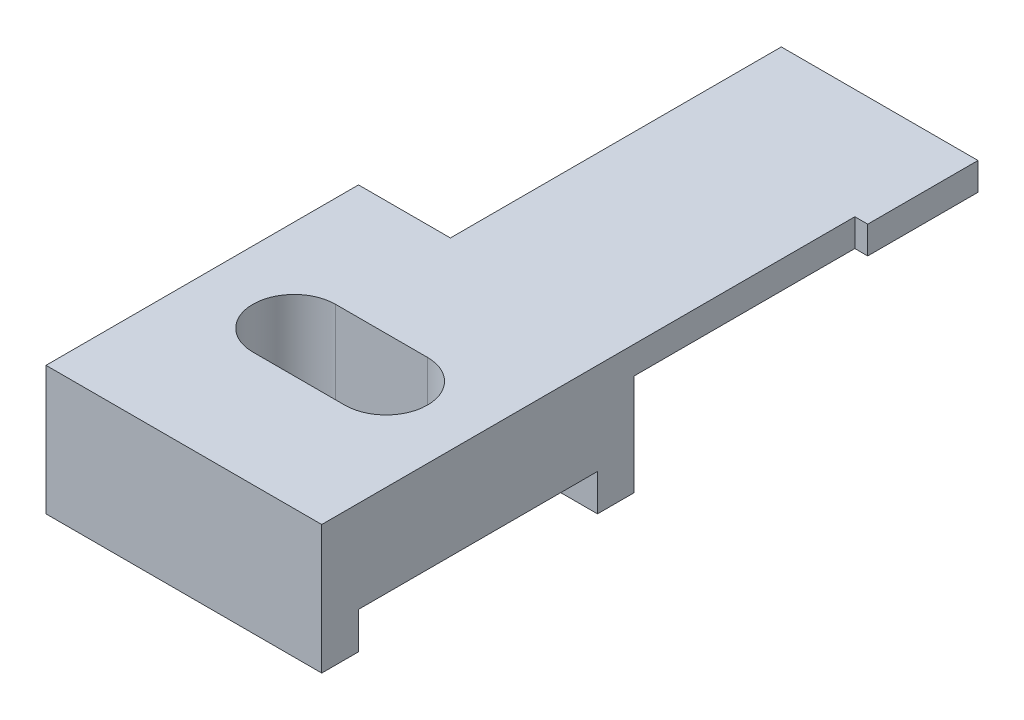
ISO-10303-21;
HEADER;
FILE_DESCRIPTION(('STEP AP214'),'2;1');
FILE_NAME('part.step','',(''),(''),'','','');
FILE_SCHEMA(('AUTOMOTIVE_DESIGN { 1 0 10303 214 1 1 1 1 }'));
ENDSEC;
DATA;
#1=APPLICATION_CONTEXT('core data for automotive mechanical design processes');
#2=APPLICATION_PROTOCOL_DEFINITION('international standard','automotive_design',2000,#1);
#3=PRODUCT_CONTEXT('',#1,'mechanical');
#4=PRODUCT('Part','Part','',(#3));
#5=PRODUCT_RELATED_PRODUCT_CATEGORY('part','',(#4));
#6=PRODUCT_DEFINITION_FORMATION('','',#4);
#7=PRODUCT_DEFINITION_CONTEXT('part definition',#1,'design');
#8=PRODUCT_DEFINITION('design','',#6,#7);
#9=PRODUCT_DEFINITION_SHAPE('','',#8);
#10=(LENGTH_UNIT() NAMED_UNIT(*) SI_UNIT(.MILLI.,.METRE.));
#11=(NAMED_UNIT(*) PLANE_ANGLE_UNIT() SI_UNIT($,.RADIAN.));
#12=(NAMED_UNIT(*) SI_UNIT($,.STERADIAN.) SOLID_ANGLE_UNIT());
#13=UNCERTAINTY_MEASURE_WITH_UNIT(LENGTH_MEASURE(1.E-05),#10,'distance_accuracy_value','');
#14=(GEOMETRIC_REPRESENTATION_CONTEXT(3) GLOBAL_UNCERTAINTY_ASSIGNED_CONTEXT((#13)) GLOBAL_UNIT_ASSIGNED_CONTEXT((#10,
#11,#12)) REPRESENTATION_CONTEXT('',''));
#15=CARTESIAN_POINT('',(0.,0.,0.));
#16=DIRECTION('',(0.,0.,1.));
#17=DIRECTION('',(1.,0.,0.));
#18=AXIS2_PLACEMENT_3D('',#15,#16,#17);
#19=CARTESIAN_POINT('',(0.,0.,35.));
#20=DIRECTION('',(1.,0.,0.));
#21=DIRECTION('',(0.,0.,-1.));
#22=AXIS2_PLACEMENT_3D('',#19,#20,#21);
#23=PLANE('',#22);
#24=DIRECTION('',(0.,0.,-1.));
#25=VECTOR('',#24,1.);
#26=CARTESIAN_POINT('',(0.,7.,35.));
#27=LINE('',#26,#25);
#28=CARTESIAN_POINT('',(0.,7.,35.));
#29=VERTEX_POINT('',#28);
#30=CARTESIAN_POINT('',(0.,7.,18.0000000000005));
#31=VERTEX_POINT('',#30);
#32=EDGE_CURVE('E256',#29,#31,#27,.T.);
#33=ORIENTED_EDGE('',*,*,#32,.T.);
#34=DIRECTION('',(0.,1.,-1.65902645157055E-13));
#35=VECTOR('',#34,1.);
#36=CARTESIAN_POINT('',(0.,-2.82034496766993E-12,18.));
#37=LINE('',#36,#35);
#38=CARTESIAN_POINT('',(0.,-1.13686837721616E-13,18.));
#39=VERTEX_POINT('',#38);
#40=EDGE_CURVE('E232',#39,#31,#37,.T.);
#41=ORIENTED_EDGE('',*,*,#40,.F.);
#42=DIRECTION('',(0.,0.,-1.));
#43=VECTOR('',#42,1.);
#44=CARTESIAN_POINT('',(0.,0.,35.));
#45=LINE('',#44,#43);
#46=CARTESIAN_POINT('',(0.,-1.13686837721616E-13,20.));
#47=VERTEX_POINT('',#46);
#48=EDGE_CURVE('E252',#47,#39,#45,.T.);
#49=ORIENTED_EDGE('',*,*,#48,.F.);
#50=DIRECTION('',(0.,-1.,0.));
#51=VECTOR('',#50,1.);
#52=CARTESIAN_POINT('',(0.,0.,20.));
#53=LINE('',#52,#51);
#54=CARTESIAN_POINT('',(0.,1.99999999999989,20.));
#55=VERTEX_POINT('',#54);
#56=EDGE_CURVE('E230',#55,#47,#53,.T.);
#57=ORIENTED_EDGE('',*,*,#56,.F.);
#58=DIRECTION('',(0.,0.,-1.));
#59=VECTOR('',#58,1.);
#60=CARTESIAN_POINT('',(0.,1.99999999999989,35.));
#61=LINE('',#60,#59);
#62=CARTESIAN_POINT('',(0.,1.99999999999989,33.0000000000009));
#63=VERTEX_POINT('',#62);
#64=EDGE_CURVE('E228',#63,#55,#61,.T.);
#65=ORIENTED_EDGE('',*,*,#64,.F.);
#66=DIRECTION('',(0.,1.,4.54497550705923E-13));
#67=VECTOR('',#66,1.);
#68=CARTESIAN_POINT('',(0.,9.08995101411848E-13,33.));
#69=LINE('',#68,#67);
#70=CARTESIAN_POINT('',(0.,-1.13686837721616E-13,33.));
#71=VERTEX_POINT('',#70);
#72=EDGE_CURVE('E214',#71,#63,#69,.T.);
#73=ORIENTED_EDGE('',*,*,#72,.F.);
#74=CARTESIAN_POINT('',(0.,0.,35.));
#75=VERTEX_POINT('',#74);
#76=EDGE_CURVE('E253',#75,#71,#45,.T.);
#77=ORIENTED_EDGE('',*,*,#76,.F.);
#78=DIRECTION('',(0.,-1.,0.));
#79=VECTOR('',#78,1.);
#80=CARTESIAN_POINT('',(0.,0.,35.));
#81=LINE('',#80,#79);
#82=EDGE_CURVE('E236',#29,#75,#81,.T.);
#83=ORIENTED_EDGE('',*,*,#82,.F.);
#84=EDGE_LOOP('',(#33,#41,#49,#57,#65,#73,#77,#83));
#85=FACE_BOUND('',#84,.T.);
#86=ADVANCED_FACE('F34',(#85),#23,.F.);
#87=CARTESIAN_POINT('',(15.7000000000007,5.5,0.));
#88=DIRECTION('',(0.,0.,1.));
#89=DIRECTION('',(1.,0.,0.));
#90=AXIS2_PLACEMENT_3D('',#87,#88,#89);
#91=PLANE('',#90);
#92=DIRECTION('',(0.,1.,0.));
#93=VECTOR('',#92,1.);
#94=CARTESIAN_POINT('',(5.,-28.,4.54747350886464E-13));
#95=LINE('',#94,#93);
#96=CARTESIAN_POINT('',(5.,5.5,4.54747350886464E-13));
#97=VERTEX_POINT('',#96);
#98=CARTESIAN_POINT('',(5.,7.,4.54747350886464E-13));
#99=VERTEX_POINT('',#98);
#100=EDGE_CURVE('E182',#97,#99,#95,.T.);
#101=ORIENTED_EDGE('',*,*,#100,.T.);
#102=DIRECTION('',(-1.,0.,0.));
#103=VECTOR('',#102,1.);
#104=CARTESIAN_POINT('',(0.,7.,0.));
#105=LINE('',#104,#103);
#106=CARTESIAN_POINT('',(15.7000000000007,7.,0.));
#107=VERTEX_POINT('',#106);
#108=EDGE_CURVE('E237',#107,#99,#105,.T.);
#109=ORIENTED_EDGE('',*,*,#108,.F.);
#110=DIRECTION('',(0.,1.,0.));
#111=VECTOR('',#110,1.);
#112=CARTESIAN_POINT('',(15.7000000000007,5.5,0.));
#113=LINE('',#112,#111);
#114=CARTESIAN_POINT('',(15.7000000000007,5.5,0.));
#115=VERTEX_POINT('',#114);
#116=EDGE_CURVE('E244',#115,#107,#113,.T.);
#117=ORIENTED_EDGE('',*,*,#116,.F.);
#118=DIRECTION('',(1.,0.,0.));
#119=VECTOR('',#118,1.);
#120=CARTESIAN_POINT('',(15.0000000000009,5.5,0.));
#121=LINE('',#120,#119);
#122=EDGE_CURVE('E234',#97,#115,#121,.T.);
#123=ORIENTED_EDGE('',*,*,#122,.F.);
#124=EDGE_LOOP('',(#101,#109,#117,#123));
#125=FACE_BOUND('',#124,.T.);
#126=ADVANCED_FACE('F314',(#125),#91,.F.);
#127=CARTESIAN_POINT('',(15.0000000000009,5.5,35.));
#128=DIRECTION('',(0.,1.,0.));
#129=DIRECTION('',(0.,0.,1.));
#130=AXIS2_PLACEMENT_3D('',#127,#128,#129);
#131=PLANE('',#130);
#132=DIRECTION('',(0.,0.,1.));
#133=VECTOR('',#132,1.);
#134=CARTESIAN_POINT('',(5.,5.5,35.));
#135=LINE('',#134,#133);
#136=CARTESIAN_POINT('',(5.,5.49999999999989,18.0000000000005));
#137=VERTEX_POINT('',#136);
#138=EDGE_CURVE('E187',#97,#137,#135,.T.);
#139=ORIENTED_EDGE('',*,*,#138,.F.);
#140=ORIENTED_EDGE('',*,*,#122,.T.);
#141=DIRECTION('',(0.,0.,-1.));
#142=VECTOR('',#141,1.);
#143=CARTESIAN_POINT('',(15.7000000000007,5.5,35.));
#144=LINE('',#143,#142);
#145=CARTESIAN_POINT('',(15.6999999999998,5.5,6.00000000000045));
#146=VERTEX_POINT('',#145);
#147=EDGE_CURVE('E261',#146,#115,#144,.T.);
#148=ORIENTED_EDGE('',*,*,#147,.F.);
#149=DIRECTION('',(1.,0.,0.));
#150=VECTOR('',#149,1.);
#151=CARTESIAN_POINT('',(15.0000000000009,5.5,6.00000000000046));
#152=LINE('',#151,#150);
#153=CARTESIAN_POINT('',(15.0000000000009,5.5,6.00000000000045));
#154=VERTEX_POINT('',#153);
#155=EDGE_CURVE('E189',#154,#146,#152,.T.);
#156=ORIENTED_EDGE('',*,*,#155,.F.);
#157=DIRECTION('',(0.,0.,-1.));
#158=VECTOR('',#157,1.);
#159=CARTESIAN_POINT('',(15.,5.5,35.));
#160=LINE('',#159,#158);
#161=CARTESIAN_POINT('',(15.0000000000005,5.49999999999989,17.9999999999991));
#162=VERTEX_POINT('',#161);
#163=EDGE_CURVE('E159',#162,#154,#160,.T.);
#164=ORIENTED_EDGE('',*,*,#163,.F.);
#165=DIRECTION('',(1.,0.,0.));
#166=VECTOR('',#165,1.);
#167=CARTESIAN_POINT('',(-19.2999999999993,5.49999999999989,17.9999999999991));
#168=LINE('',#167,#166);
#169=EDGE_CURVE('E205',#137,#162,#168,.T.);
#170=ORIENTED_EDGE('',*,*,#169,.F.);
#171=EDGE_LOOP('',(#139,#140,#148,#156,#164,#170));
#172=FACE_BOUND('',#171,.T.);
#173=ADVANCED_FACE('F36',(#172),#131,.F.);
#174=CARTESIAN_POINT('',(15.7000000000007,5.5,35.));
#175=DIRECTION('',(-1.,0.,0.));
#176=DIRECTION('',(0.,0.,1.));
#177=AXIS2_PLACEMENT_3D('',#174,#175,#176);
#178=PLANE('',#177);
#179=DIRECTION('',(0.,1.,0.));
#180=VECTOR('',#179,1.);
#181=CARTESIAN_POINT('',(15.6999999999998,-28.,6.00000000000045));
#182=LINE('',#181,#180);
#183=CARTESIAN_POINT('',(15.6999999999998,7.,6.00000000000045));
#184=VERTEX_POINT('',#183);
#185=EDGE_CURVE('E162',#146,#184,#182,.T.);
#186=ORIENTED_EDGE('',*,*,#185,.F.);
#187=ORIENTED_EDGE('',*,*,#147,.T.);
#188=ORIENTED_EDGE('',*,*,#116,.T.);
#189=DIRECTION('',(0.,0.,-1.));
#190=VECTOR('',#189,1.);
#191=CARTESIAN_POINT('',(15.7000000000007,7.,35.));
#192=LINE('',#191,#190);
#193=EDGE_CURVE('E259',#184,#107,#192,.T.);
#194=ORIENTED_EDGE('',*,*,#193,.F.);
#195=EDGE_LOOP('',(#186,#187,#188,#194));
#196=FACE_BOUND('',#195,.T.);
#197=ADVANCED_FACE('F303',(#196),#178,.F.);
#198=CARTESIAN_POINT('',(0.,7.,35.));
#199=DIRECTION('',(0.,-1.,0.));
#200=DIRECTION('',(0.,0.,-1.));
#201=AXIS2_PLACEMENT_3D('',#198,#199,#200);
#202=PLANE('',#201);
#203=DIRECTION('',(-1.,0.,0.));
#204=VECTOR('',#203,1.);
#205=CARTESIAN_POINT('',(10.,7.,24.2500000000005));
#206=LINE('',#205,#204);
#207=CARTESIAN_POINT('',(10.,7.,24.2500000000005));
#208=VERTEX_POINT('',#207);
#209=CARTESIAN_POINT('',(5.,7.,24.2500000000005));
#210=VERTEX_POINT('',#209);
#211=EDGE_CURVE('E193',#208,#210,#206,.T.);
#212=ORIENTED_EDGE('',*,*,#211,.F.);
#213=CARTESIAN_POINT('',(10.,7.,26.5000000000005));
#214=DIRECTION('',(0.,1.,0.));
#215=DIRECTION('',(0.,0.,1.));
#216=AXIS2_PLACEMENT_3D('',#213,#214,#215);
#217=CIRCLE('',#216,2.25);
#218=CARTESIAN_POINT('',(10.,7.,28.7500000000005));
#219=VERTEX_POINT('',#218);
#220=EDGE_CURVE('E191',#219,#208,#217,.T.);
#221=ORIENTED_EDGE('',*,*,#220,.F.);
#222=DIRECTION('',(1.,0.,0.));
#223=VECTOR('',#222,1.);
#224=CARTESIAN_POINT('',(5.,7.,28.7500000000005));
#225=LINE('',#224,#223);
#226=CARTESIAN_POINT('',(5.,7.,28.7500000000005));
#227=VERTEX_POINT('',#226);
#228=EDGE_CURVE('E199',#227,#219,#225,.T.);
#229=ORIENTED_EDGE('',*,*,#228,.F.);
#230=CARTESIAN_POINT('',(5.,7.,26.5000000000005));
#231=DIRECTION('',(0.,1.,0.));
#232=DIRECTION('',(0.,0.,1.));
#233=AXIS2_PLACEMENT_3D('',#230,#231,#232);
#234=CIRCLE('',#233,2.25);
#235=EDGE_CURVE('E196',#210,#227,#234,.T.);
#236=ORIENTED_EDGE('',*,*,#235,.F.);
#237=EDGE_LOOP('',(#212,#221,#229,#236));
#238=FACE_BOUND('',#237,.T.);
#239=DIRECTION('',(-1.,0.,0.));
#240=VECTOR('',#239,1.);
#241=CARTESIAN_POINT('',(0.,7.,18.0000000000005));
#242=LINE('',#241,#240);
#243=CARTESIAN_POINT('',(5.,7.,18.0000000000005));
#244=VERTEX_POINT('',#243);
#245=EDGE_CURVE('E49',#244,#31,#242,.T.);
#246=ORIENTED_EDGE('',*,*,#245,.T.);
#247=ORIENTED_EDGE('',*,*,#32,.F.);
#248=DIRECTION('',(-1.,0.,0.));
#249=VECTOR('',#248,1.);
#250=CARTESIAN_POINT('',(0.,7.,35.));
#251=LINE('',#250,#249);
#252=CARTESIAN_POINT('',(15.,7.,35.));
#253=VERTEX_POINT('',#252);
#254=EDGE_CURVE('E174',#253,#29,#251,.T.);
#255=ORIENTED_EDGE('',*,*,#254,.F.);
#256=DIRECTION('',(0.,0.,-1.));
#257=VECTOR('',#256,1.);
#258=CARTESIAN_POINT('',(15.,7.,35.0000000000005));
#259=LINE('',#258,#257);
#260=CARTESIAN_POINT('',(15.0000000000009,7.,6.00000000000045));
#261=VERTEX_POINT('',#260);
#262=EDGE_CURVE('E157',#253,#261,#259,.T.);
#263=ORIENTED_EDGE('',*,*,#262,.T.);
#264=DIRECTION('',(1.,0.,0.));
#265=VECTOR('',#264,1.);
#266=CARTESIAN_POINT('',(15.0000000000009,7.,6.00000000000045));
#267=LINE('',#266,#265);
#268=EDGE_CURVE('E165',#261,#184,#267,.T.);
#269=ORIENTED_EDGE('',*,*,#268,.T.);
#270=ORIENTED_EDGE('',*,*,#193,.T.);
#271=ORIENTED_EDGE('',*,*,#108,.T.);
#272=DIRECTION('',(0.,0.,1.));
#273=VECTOR('',#272,1.);
#274=CARTESIAN_POINT('',(5.,7.,18.0000000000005));
#275=LINE('',#274,#273);
#276=EDGE_CURVE('E170',#99,#244,#275,.T.);
#277=ORIENTED_EDGE('',*,*,#276,.T.);
#278=EDGE_LOOP('',(#246,#247,#255,#263,#269,#270,#271,#277));
#279=FACE_BOUND('',#278,.T.);
#280=ADVANCED_FACE('F172',(#238,#279),#202,.F.);
#281=CARTESIAN_POINT('',(15.7000000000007,5.5,35.));
#282=DIRECTION('',(0.,0.,1.));
#283=DIRECTION('',(1.,0.,0.));
#284=AXIS2_PLACEMENT_3D('',#281,#282,#283);
#285=PLANE('',#284);
#286=DIRECTION('',(0.,1.,0.));
#287=VECTOR('',#286,1.);
#288=CARTESIAN_POINT('',(15.0000000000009,0.,35.));
#289=LINE('',#288,#287);
#290=CARTESIAN_POINT('',(15.0000000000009,0.,35.));
#291=VERTEX_POINT('',#290);
#292=EDGE_CURVE('E57',#291,#253,#289,.T.);
#293=ORIENTED_EDGE('',*,*,#292,.T.);
#294=ORIENTED_EDGE('',*,*,#254,.T.);
#295=ORIENTED_EDGE('',*,*,#82,.T.);
#296=DIRECTION('',(1.,0.,0.));
#297=VECTOR('',#296,1.);
#298=CARTESIAN_POINT('',(0.,0.,35.));
#299=LINE('',#298,#297);
#300=EDGE_CURVE('E239',#75,#291,#299,.T.);
#301=ORIENTED_EDGE('',*,*,#300,.T.);
#302=EDGE_LOOP('',(#293,#294,#295,#301));
#303=FACE_BOUND('',#302,.T.);
#304=ADVANCED_FACE('F302',(#303),#285,.T.);
#305=CARTESIAN_POINT('',(0.,0.,35.));
#306=DIRECTION('',(0.,1.,0.));
#307=DIRECTION('',(0.,0.,1.));
#308=AXIS2_PLACEMENT_3D('',#305,#306,#307);
#309=PLANE('',#308);
#310=DIRECTION('',(1.,0.,0.));
#311=VECTOR('',#310,1.);
#312=CARTESIAN_POINT('',(-19.2999999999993,-1.13686837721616E-13,18.));
#313=LINE('',#312,#311);
#314=CARTESIAN_POINT('',(15.0000000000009,-1.13686837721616E-13,18.));
#315=VERTEX_POINT('',#314);
#316=EDGE_CURVE('E212',#39,#315,#313,.T.);
#317=ORIENTED_EDGE('',*,*,#316,.T.);
#318=DIRECTION('',(0.,0.,-1.));
#319=VECTOR('',#318,1.);
#320=CARTESIAN_POINT('',(15.0000000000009,0.,35.));
#321=LINE('',#320,#319);
#322=CARTESIAN_POINT('',(15.0000000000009,-1.13686837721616E-13,20.));
#323=VERTEX_POINT('',#322);
#324=EDGE_CURVE('E242',#323,#315,#321,.T.);
#325=ORIENTED_EDGE('',*,*,#324,.F.);
#326=DIRECTION('',(1.,0.,0.));
#327=VECTOR('',#326,1.);
#328=CARTESIAN_POINT('',(-19.2999999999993,-1.13686837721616E-13,20.));
#329=LINE('',#328,#327);
#330=EDGE_CURVE('E215',#47,#323,#329,.T.);
#331=ORIENTED_EDGE('',*,*,#330,.F.);
#332=ORIENTED_EDGE('',*,*,#48,.T.);
#333=EDGE_LOOP('',(#317,#325,#331,#332));
#334=FACE_BOUND('',#333,.T.);
#335=ADVANCED_FACE('F309',(#334),#309,.F.);
#336=DIRECTION('',(1.,0.,0.));
#337=VECTOR('',#336,1.);
#338=CARTESIAN_POINT('',(-19.2999999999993,-1.13686837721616E-13,33.));
#339=LINE('',#338,#337);
#340=CARTESIAN_POINT('',(15.0000000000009,-1.13686837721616E-13,33.));
#341=VERTEX_POINT('',#340);
#342=EDGE_CURVE('E222',#71,#341,#339,.T.);
#343=ORIENTED_EDGE('',*,*,#342,.T.);
#344=EDGE_CURVE('E249',#291,#341,#321,.T.);
#345=ORIENTED_EDGE('',*,*,#344,.F.);
#346=ORIENTED_EDGE('',*,*,#300,.F.);
#347=ORIENTED_EDGE('',*,*,#76,.T.);
#348=EDGE_LOOP('',(#343,#345,#346,#347));
#349=FACE_BOUND('',#348,.T.);
#350=ADVANCED_FACE('F324',(#349),#309,.F.);
#351=CARTESIAN_POINT('',(15.0000000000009,0.,35.));
#352=DIRECTION('',(-1.,0.,0.));
#353=DIRECTION('',(0.,0.,1.));
#354=AXIS2_PLACEMENT_3D('',#351,#352,#353);
#355=PLANE('',#354);
#356=DIRECTION('',(0.,-1.,1.65902645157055E-13));
#357=VECTOR('',#356,1.);
#358=CARTESIAN_POINT('',(15.0000000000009,-2.82034496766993E-12,18.));
#359=LINE('',#358,#357);
#360=EDGE_CURVE('E271',#162,#315,#359,.T.);
#361=ORIENTED_EDGE('',*,*,#360,.F.);
#362=ORIENTED_EDGE('',*,*,#163,.T.);
#363=DIRECTION('',(0.,1.,0.));
#364=VECTOR('',#363,1.);
#365=CARTESIAN_POINT('',(15.0000000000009,-28.,6.00000000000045));
#366=LINE('',#365,#364);
#367=EDGE_CURVE('E152',#154,#261,#366,.T.);
#368=ORIENTED_EDGE('',*,*,#367,.T.);
#369=ORIENTED_EDGE('',*,*,#262,.F.);
#370=ORIENTED_EDGE('',*,*,#292,.F.);
#371=ORIENTED_EDGE('',*,*,#344,.T.);
#372=DIRECTION('',(0.,-1.,-4.54497550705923E-13));
#373=VECTOR('',#372,1.);
#374=CARTESIAN_POINT('',(15.0000000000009,9.08995101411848E-13,33.));
#375=LINE('',#374,#373);
#376=CARTESIAN_POINT('',(15.0000000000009,1.99999999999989,33.0000000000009));
#377=VERTEX_POINT('',#376);
#378=EDGE_CURVE('E264',#377,#341,#375,.T.);
#379=ORIENTED_EDGE('',*,*,#378,.F.);
#380=DIRECTION('',(0.,0.,1.));
#381=VECTOR('',#380,1.);
#382=CARTESIAN_POINT('',(15.0000000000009,1.99999999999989,35.));
#383=LINE('',#382,#381);
#384=CARTESIAN_POINT('',(15.0000000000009,1.99999999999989,20.));
#385=VERTEX_POINT('',#384);
#386=EDGE_CURVE('E266',#385,#377,#383,.T.);
#387=ORIENTED_EDGE('',*,*,#386,.F.);
#388=DIRECTION('',(0.,1.,0.));
#389=VECTOR('',#388,1.);
#390=CARTESIAN_POINT('',(15.0000000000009,0.,20.));
#391=LINE('',#390,#389);
#392=EDGE_CURVE('E269',#323,#385,#391,.T.);
#393=ORIENTED_EDGE('',*,*,#392,.F.);
#394=ORIENTED_EDGE('',*,*,#324,.T.);
#395=EDGE_LOOP('',(#361,#362,#368,#369,#370,#371,#379,#387,#393,#394));
#396=FACE_BOUND('',#395,.T.);
#397=ADVANCED_FACE('F155',(#396),#355,.F.);
#398=CARTESIAN_POINT('',(-19.2999999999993,5.49999999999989,17.9999999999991));
#399=DIRECTION('',(0.,-1.65902645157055E-13,-1.));
#400=DIRECTION('',(0.,1.,-1.65902645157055E-13));
#401=AXIS2_PLACEMENT_3D('',#398,#399,#400);
#402=PLANE('',#401);
#403=ORIENTED_EDGE('',*,*,#40,.T.);
#404=ORIENTED_EDGE('',*,*,#245,.F.);
#405=DIRECTION('',(0.,1.,0.));
#406=VECTOR('',#405,1.);
#407=CARTESIAN_POINT('',(5.,-28.,18.0000000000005));
#408=LINE('',#407,#406);
#409=EDGE_CURVE('E180',#137,#244,#408,.T.);
#410=ORIENTED_EDGE('',*,*,#409,.F.);
#411=ORIENTED_EDGE('',*,*,#169,.T.);
#412=ORIENTED_EDGE('',*,*,#360,.T.);
#413=ORIENTED_EDGE('',*,*,#316,.F.);
#414=EDGE_LOOP('',(#403,#404,#410,#411,#412,#413));
#415=FACE_BOUND('',#414,.T.);
#416=ADVANCED_FACE('F327',(#415),#402,.T.);
#417=CARTESIAN_POINT('',(-19.2999999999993,1.99999999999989,20.));
#418=DIRECTION('',(0.,0.,1.));
#419=DIRECTION('',(1.,0.,0.));
#420=AXIS2_PLACEMENT_3D('',#417,#418,#419);
#421=PLANE('',#420);
#422=ORIENTED_EDGE('',*,*,#56,.T.);
#423=ORIENTED_EDGE('',*,*,#330,.T.);
#424=ORIENTED_EDGE('',*,*,#392,.T.);
#425=DIRECTION('',(1.,0.,0.));
#426=VECTOR('',#425,1.);
#427=CARTESIAN_POINT('',(-19.2999999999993,1.99999999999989,20.));
#428=LINE('',#427,#426);
#429=EDGE_CURVE('E217',#55,#385,#428,.T.);
#430=ORIENTED_EDGE('',*,*,#429,.F.);
#431=EDGE_LOOP('',(#422,#423,#424,#430));
#432=FACE_BOUND('',#431,.T.);
#433=ADVANCED_FACE('F331',(#432),#421,.T.);
#434=CARTESIAN_POINT('',(-19.2999999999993,1.99999999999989,33.0000000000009));
#435=DIRECTION('',(0.,-1.,0.));
#436=DIRECTION('',(0.,0.,-1.));
#437=AXIS2_PLACEMENT_3D('',#434,#435,#436);
#438=PLANE('',#437);
#439=CARTESIAN_POINT('',(10.,1.99999999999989,26.5000000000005));
#440=DIRECTION('',(0.,-1.,0.));
#441=DIRECTION('',(0.,0.,-1.));
#442=AXIS2_PLACEMENT_3D('',#439,#440,#441);
#443=CIRCLE('',#442,2.25);
#444=CARTESIAN_POINT('',(10.,1.99999999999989,24.2500000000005));
#445=VERTEX_POINT('',#444);
#446=CARTESIAN_POINT('',(10.,1.99999999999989,28.7500000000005));
#447=VERTEX_POINT('',#446);
#448=EDGE_CURVE('E12',#445,#447,#443,.T.);
#449=ORIENTED_EDGE('',*,*,#448,.F.);
#450=DIRECTION('',(1.,0.,0.));
#451=VECTOR('',#450,1.);
#452=CARTESIAN_POINT('',(-19.2999999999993,1.99999999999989,24.2500000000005));
#453=LINE('',#452,#451);
#454=CARTESIAN_POINT('',(5.,1.99999999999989,24.2500000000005));
#455=VERTEX_POINT('',#454);
#456=EDGE_CURVE('E274',#455,#445,#453,.T.);
#457=ORIENTED_EDGE('',*,*,#456,.F.);
#458=CARTESIAN_POINT('',(5.,1.99999999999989,26.5000000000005));
#459=DIRECTION('',(0.,-1.,0.));
#460=DIRECTION('',(0.,0.,-1.));
#461=AXIS2_PLACEMENT_3D('',#458,#459,#460);
#462=CIRCLE('',#461,2.25);
#463=CARTESIAN_POINT('',(5.,1.99999999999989,28.7500000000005));
#464=VERTEX_POINT('',#463);
#465=EDGE_CURVE('E276',#464,#455,#462,.T.);
#466=ORIENTED_EDGE('',*,*,#465,.F.);
#467=DIRECTION('',(-1.,0.,0.));
#468=VECTOR('',#467,1.);
#469=CARTESIAN_POINT('',(-19.2999999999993,1.99999999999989,28.7500000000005));
#470=LINE('',#469,#468);
#471=EDGE_CURVE('E42',#447,#464,#470,.T.);
#472=ORIENTED_EDGE('',*,*,#471,.F.);
#473=EDGE_LOOP('',(#449,#457,#466,#472));
#474=FACE_BOUND('',#473,.T.);
#475=ORIENTED_EDGE('',*,*,#64,.T.);
#476=ORIENTED_EDGE('',*,*,#429,.T.);
#477=ORIENTED_EDGE('',*,*,#386,.T.);
#478=DIRECTION('',(1.,0.,0.));
#479=VECTOR('',#478,1.);
#480=CARTESIAN_POINT('',(-19.2999999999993,1.99999999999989,33.0000000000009));
#481=LINE('',#480,#479);
#482=EDGE_CURVE('E220',#63,#377,#481,.T.);
#483=ORIENTED_EDGE('',*,*,#482,.F.);
#484=EDGE_LOOP('',(#475,#476,#477,#483));
#485=FACE_BOUND('',#484,.T.);
#486=ADVANCED_FACE('F291',(#474,#485),#438,.T.);
#487=CARTESIAN_POINT('',(-19.2999999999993,-1.13686837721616E-13,33.));
#488=DIRECTION('',(0.,4.54497550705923E-13,-1.));
#489=DIRECTION('',(0.,1.,4.54497550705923E-13));
#490=AXIS2_PLACEMENT_3D('',#487,#488,#489);
#491=PLANE('',#490);
#492=ORIENTED_EDGE('',*,*,#72,.T.);
#493=ORIENTED_EDGE('',*,*,#482,.T.);
#494=ORIENTED_EDGE('',*,*,#378,.T.);
#495=ORIENTED_EDGE('',*,*,#342,.F.);
#496=EDGE_LOOP('',(#492,#493,#494,#495));
#497=FACE_BOUND('',#496,.T.);
#498=ADVANCED_FACE('F332',(#497),#491,.T.);
#499=CARTESIAN_POINT('',(10.,-28.,26.5000000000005));
#500=DIRECTION('',(0.,1.,0.));
#501=DIRECTION('',(0.,0.,1.));
#502=AXIS2_PLACEMENT_3D('',#499,#500,#501);
#503=CYLINDRICAL_SURFACE('',#502,2.25);
#504=ORIENTED_EDGE('',*,*,#448,.T.);
#505=DIRECTION('',(0.,1.,0.));
#506=VECTOR('',#505,1.);
#507=CARTESIAN_POINT('',(10.,-28.,28.7500000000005));
#508=LINE('',#507,#506);
#509=EDGE_CURVE('E203',#447,#219,#508,.T.);
#510=ORIENTED_EDGE('',*,*,#509,.T.);
#511=ORIENTED_EDGE('',*,*,#220,.T.);
#512=DIRECTION('',(0.,1.,0.));
#513=VECTOR('',#512,1.);
#514=CARTESIAN_POINT('',(10.,-28.,24.2500000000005));
#515=LINE('',#514,#513);
#516=EDGE_CURVE('E202',#445,#208,#515,.T.);
#517=ORIENTED_EDGE('',*,*,#516,.F.);
#518=EDGE_LOOP('',(#504,#510,#511,#517));
#519=FACE_BOUND('',#518,.T.);
#520=ADVANCED_FACE('F298',(#519),#503,.F.);
#521=CARTESIAN_POINT('',(5.,-28.,28.7500000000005));
#522=DIRECTION('',(0.,0.,1.));
#523=DIRECTION('',(1.,0.,0.));
#524=AXIS2_PLACEMENT_3D('',#521,#522,#523);
#525=PLANE('',#524);
#526=ORIENTED_EDGE('',*,*,#471,.T.);
#527=DIRECTION('',(0.,1.,0.));
#528=VECTOR('',#527,1.);
#529=CARTESIAN_POINT('',(5.,-28.,28.7500000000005));
#530=LINE('',#529,#528);
#531=EDGE_CURVE('E206',#464,#227,#530,.T.);
#532=ORIENTED_EDGE('',*,*,#531,.T.);
#533=ORIENTED_EDGE('',*,*,#228,.T.);
#534=ORIENTED_EDGE('',*,*,#509,.F.);
#535=EDGE_LOOP('',(#526,#532,#533,#534));
#536=FACE_BOUND('',#535,.T.);
#537=ADVANCED_FACE('F282',(#536),#525,.F.);
#538=CARTESIAN_POINT('',(5.,-28.,26.5000000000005));
#539=DIRECTION('',(0.,1.,0.));
#540=DIRECTION('',(0.,0.,1.));
#541=AXIS2_PLACEMENT_3D('',#538,#539,#540);
#542=CYLINDRICAL_SURFACE('',#541,2.25);
#543=ORIENTED_EDGE('',*,*,#465,.T.);
#544=DIRECTION('',(0.,1.,0.));
#545=VECTOR('',#544,1.);
#546=CARTESIAN_POINT('',(5.,-28.,24.2500000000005));
#547=LINE('',#546,#545);
#548=EDGE_CURVE('E208',#455,#210,#547,.T.);
#549=ORIENTED_EDGE('',*,*,#548,.T.);
#550=ORIENTED_EDGE('',*,*,#235,.T.);
#551=ORIENTED_EDGE('',*,*,#531,.F.);
#552=EDGE_LOOP('',(#543,#549,#550,#551));
#553=FACE_BOUND('',#552,.T.);
#554=ADVANCED_FACE('F287',(#553),#542,.F.);
#555=CARTESIAN_POINT('',(10.,-28.,24.2500000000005));
#556=DIRECTION('',(0.,0.,-1.));
#557=DIRECTION('',(-1.,0.,0.));
#558=AXIS2_PLACEMENT_3D('',#555,#556,#557);
#559=PLANE('',#558);
#560=ORIENTED_EDGE('',*,*,#456,.T.);
#561=ORIENTED_EDGE('',*,*,#516,.T.);
#562=ORIENTED_EDGE('',*,*,#211,.T.);
#563=ORIENTED_EDGE('',*,*,#548,.F.);
#564=EDGE_LOOP('',(#560,#561,#562,#563));
#565=FACE_BOUND('',#564,.T.);
#566=ADVANCED_FACE('F295',(#565),#559,.F.);
#567=CARTESIAN_POINT('',(15.0000000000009,-28.,6.00000000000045));
#568=DIRECTION('',(0.,0.,1.));
#569=DIRECTION('',(1.,0.,0.));
#570=AXIS2_PLACEMENT_3D('',#567,#568,#569);
#571=PLANE('',#570);
#572=ORIENTED_EDGE('',*,*,#155,.T.);
#573=ORIENTED_EDGE('',*,*,#185,.T.);
#574=ORIENTED_EDGE('',*,*,#268,.F.);
#575=ORIENTED_EDGE('',*,*,#367,.F.);
#576=EDGE_LOOP('',(#572,#573,#574,#575));
#577=FACE_BOUND('',#576,.T.);
#578=ADVANCED_FACE('F166',(#577),#571,.T.);
#579=CARTESIAN_POINT('',(5.,-28.,18.0000000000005));
#580=DIRECTION('',(-1.,0.,0.));
#581=DIRECTION('',(0.,0.,1.));
#582=AXIS2_PLACEMENT_3D('',#579,#580,#581);
#583=PLANE('',#582);
#584=ORIENTED_EDGE('',*,*,#138,.T.);
#585=ORIENTED_EDGE('',*,*,#409,.T.);
#586=ORIENTED_EDGE('',*,*,#276,.F.);
#587=ORIENTED_EDGE('',*,*,#100,.F.);
#588=EDGE_LOOP('',(#584,#585,#586,#587));
#589=FACE_BOUND('',#588,.T.);
#590=ADVANCED_FACE('F351',(#589),#583,.T.);
#591=CLOSED_SHELL('',(#86,#126,#173,#197,#280,#304,#335,#350,#397,#416,#433,#486,#498,#520,#537,
#554,#566,#578,#590));
#592=MANIFOLD_SOLID_BREP('B2',#591);
#593=ADVANCED_BREP_SHAPE_REPRESENTATION('',(#18,#592),#14);
#594=SHAPE_DEFINITION_REPRESENTATION(#9,#593);
ENDSEC;
END-ISO-10303-21;
